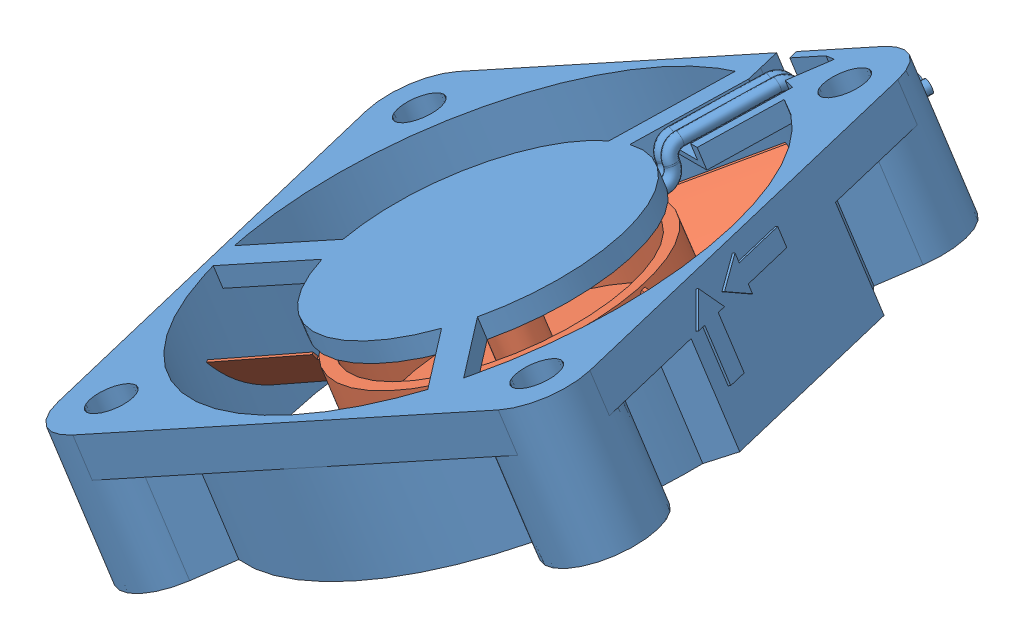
SolidWorks assembly 40x40x10 fan cooler 5v sunon.SLDASM, configuration Default (file format 7000). Lengths in mm.
Overall size (49.46 30.29 52.98).
2 component instances, 2 part files, 2 mates.
Components (placement in the parent):
- 40x40x10-1: 40x40x10.SLDPRT [Default] at (15.2384 13.7872 50.2788) x (-0.206381 0.038763 -0.977704) z (-0.893411 -0.414952 0.172137) size (44.65 10.7 40.2)
- blade-1: blade.SLDPRT [Default] at (16.5552 10.7874 49.8819) x (-0.338768 -0.268033 0.901884) z (0.852064 0.319133 0.414898) size (37.1 8.47 37.1)
Mates (geometry in assembly coordinates):
- Concentric1: concentric aligned: cylinder of 40x40x10-1 through (18.2311 6.9695 49.3768) axis (-0.399027 0.909017 0.120269) radius 0.75; cylinder of blade-1 through (30.6345 -21.2866 45.6383) axis (-0.399027 0.909017 0.120269) radius 0.75
- Distance1: distance = 1.8 mm anti-aligned: plane of blade-1 through (16.5552 10.7874 49.8819) normal (-0.399027 0.909017 0.120269); plane of 40x40x10-1 through (15.8369 12.4236 50.0984) normal (0.399027 -0.909017 -0.120269)
